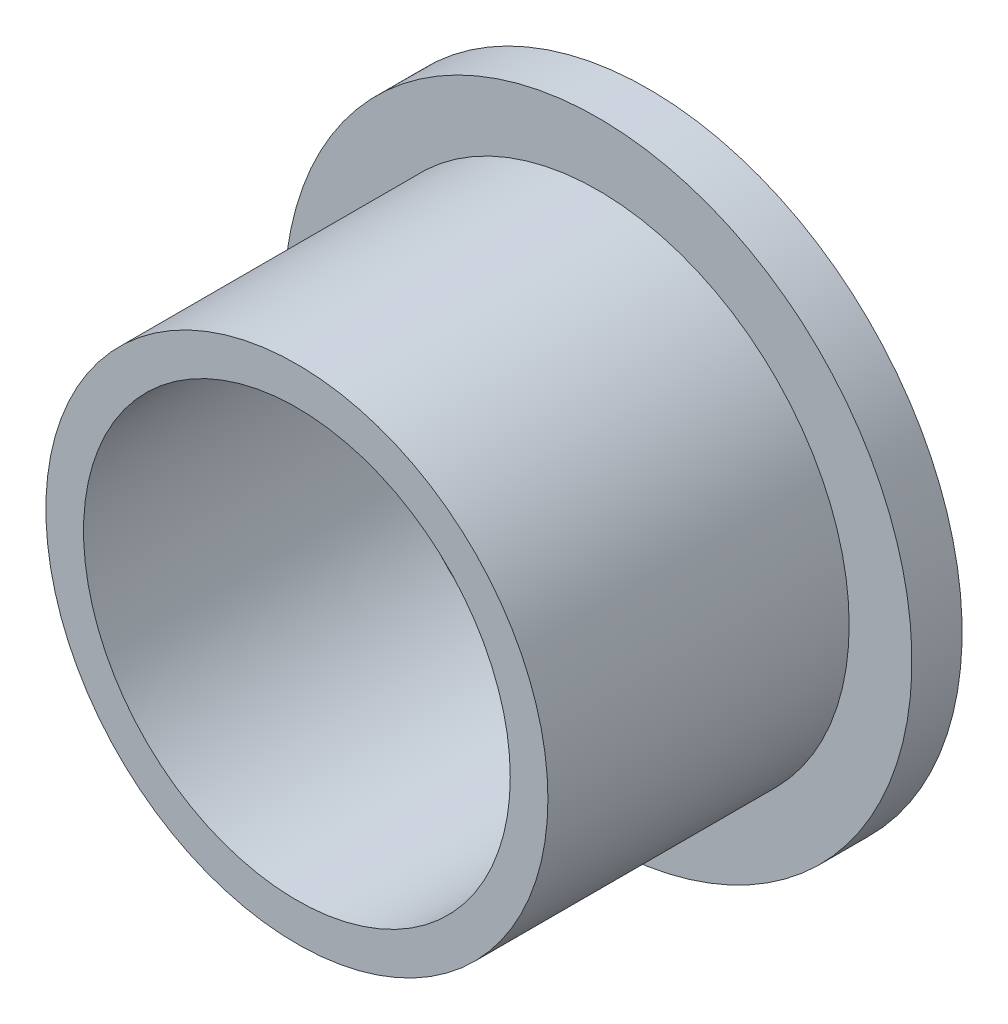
from build123d import *

# Parameters (mm, degrees)
SKETCH1_R           = 10
SKETCH1_R_2         = 8.5
BOSS_EXTRUDE1_DEPTH = 12
SKETCH2_R           = 12.5
BOSS_EXTRUDE2_DEPTH = 2


with BuildPart() as part:
    # Sketch1 → Boss-Extrude1 (new body)
    with BuildSketch(Plane.XY):
        Circle(SKETCH1_R)
        Circle(SKETCH1_R_2, mode=Mode.SUBTRACT)
    extrude(amount=BOSS_EXTRUDE1_DEPTH)

    # Sketch2 → Boss-Extrude2 (add)
    with BuildSketch(Plane(origin=(0, 0, 0), x_dir=(-1, 0, 0), z_dir=(0, 0, -1))):
        Circle(SKETCH2_R)
    extrude(amount=BOSS_EXTRUDE2_DEPTH)


solid = part.part
